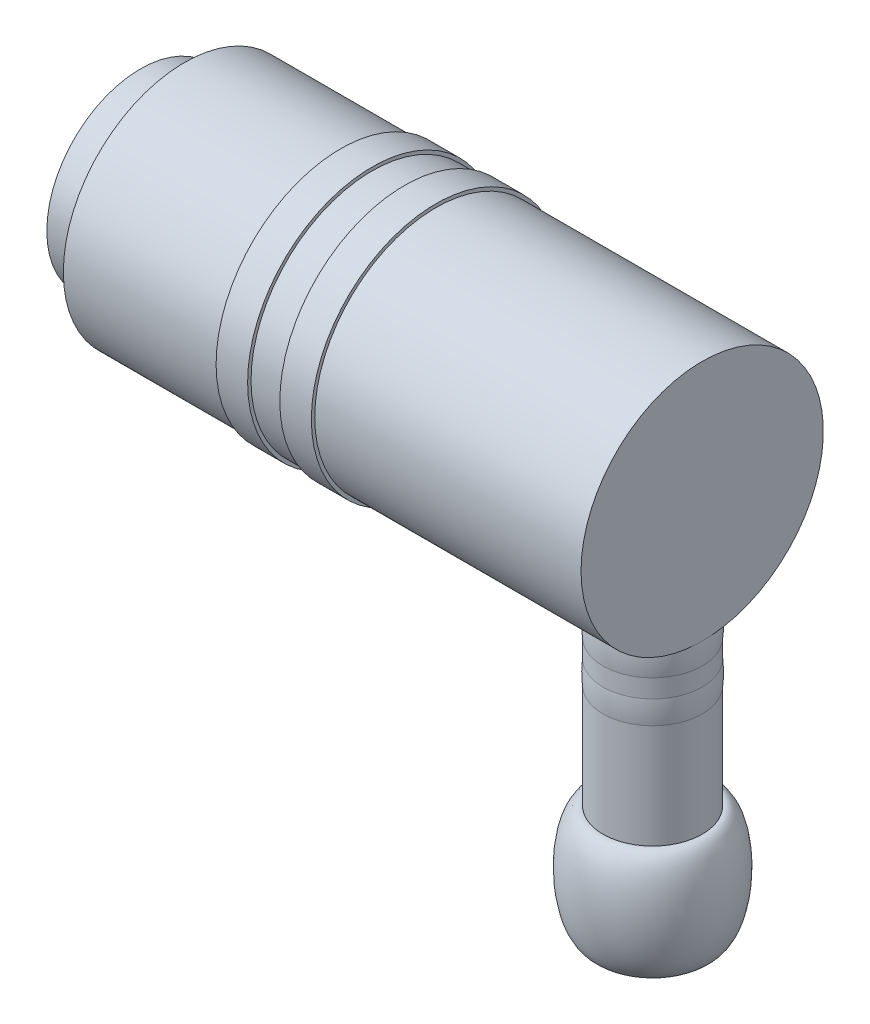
ISO-10303-21;
HEADER;
FILE_DESCRIPTION(('STEP AP214'),'2;1');
FILE_NAME('part.step','',(''),(''),'','','');
FILE_SCHEMA(('AUTOMOTIVE_DESIGN { 1 0 10303 214 1 1 1 1 }'));
ENDSEC;
DATA;
#1=APPLICATION_CONTEXT('core data for automotive mechanical design processes');
#2=APPLICATION_PROTOCOL_DEFINITION('international standard','automotive_design',2000,#1);
#3=PRODUCT_CONTEXT('',#1,'mechanical');
#4=PRODUCT('Part','Part','',(#3));
#5=PRODUCT_RELATED_PRODUCT_CATEGORY('part','',(#4));
#6=PRODUCT_DEFINITION_FORMATION('','',#4);
#7=PRODUCT_DEFINITION_CONTEXT('part definition',#1,'design');
#8=PRODUCT_DEFINITION('design','',#6,#7);
#9=PRODUCT_DEFINITION_SHAPE('','',#8);
#10=(LENGTH_UNIT() NAMED_UNIT(*) SI_UNIT(.MILLI.,.METRE.));
#11=(NAMED_UNIT(*) PLANE_ANGLE_UNIT() SI_UNIT($,.RADIAN.));
#12=(NAMED_UNIT(*) SI_UNIT($,.STERADIAN.) SOLID_ANGLE_UNIT());
#13=UNCERTAINTY_MEASURE_WITH_UNIT(LENGTH_MEASURE(1.E-05),#10,'distance_accuracy_value','');
#14=(GEOMETRIC_REPRESENTATION_CONTEXT(3) GLOBAL_UNCERTAINTY_ASSIGNED_CONTEXT((#13)) GLOBAL_UNIT_ASSIGNED_CONTEXT((#10,
#11,#12)) REPRESENTATION_CONTEXT('',''));
#15=CARTESIAN_POINT('',(0.,0.,0.));
#16=DIRECTION('',(0.,0.,1.));
#17=DIRECTION('',(1.,0.,0.));
#18=AXIS2_PLACEMENT_3D('',#15,#16,#17);
#19=CARTESIAN_POINT('',(46.5,-11.9034368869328,0.));
#20=DIRECTION('',(0.,1.,0.));
#21=DIRECTION('',(-1.,0.,0.));
#22=AXIS2_PLACEMENT_3D('',#19,#20,#21);
#23=DEGENERATE_TOROIDAL_SURFACE('',#22,6.24826094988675,10.8000061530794,.F.);
#24=CARTESIAN_POINT('',(46.5,-10.8474920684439,0.));
#25=DIRECTION('',(0.,1.,0.));
#26=DIRECTION('',(-1.,0.,0.));
#27=AXIS2_PLACEMENT_3D('',#24,#25,#26);
#28=CIRCLE('',#27,4.5);
#29=CARTESIAN_POINT('',(42.,-10.8474920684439,0.));
#30=VERTEX_POINT('',#29);
#31=EDGE_CURVE('P0_E9',#30,#30,#28,.T.);
#32=ORIENTED_EDGE('',*,*,#31,.F.);
#33=EDGE_LOOP('',(#32));
#34=FACE_BOUND('',#33,.T.);
#35=CARTESIAN_POINT('',(46.5,-12.9593817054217,0.));
#36=DIRECTION('',(0.,1.,0.));
#37=DIRECTION('',(-1.,0.,0.));
#38=AXIS2_PLACEMENT_3D('',#35,#36,#37);
#39=CIRCLE('',#38,4.5);
#40=CARTESIAN_POINT('',(42.,-12.9593817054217,0.));
#41=VERTEX_POINT('',#40);
#42=EDGE_CURVE('P0_E45',#41,#41,#39,.T.);
#43=ORIENTED_EDGE('',*,*,#42,.T.);
#44=EDGE_LOOP('',(#43));
#45=FACE_BOUND('',#44,.T.);
#46=ADVANCED_FACE('P0_F14',(#34,#45),#23,.F.);
#47=CARTESIAN_POINT('',(46.5,-8.48200597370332,0.));
#48=DIRECTION('',(0.,1.,0.));
#49=DIRECTION('',(-1.,0.,0.));
#50=AXIS2_PLACEMENT_3D('',#47,#48,#49);
#51=CYLINDRICAL_SURFACE('',#50,4.5);
#52=CARTESIAN_POINT('',(46.5,-8.48200597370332,0.));
#53=DIRECTION('',(0.,1.,0.));
#54=DIRECTION('',(-1.,0.,0.));
#55=AXIS2_PLACEMENT_3D('',#52,#53,#54);
#56=CIRCLE('',#55,4.5);
#57=CARTESIAN_POINT('',(42.,-8.48200597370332,0.));
#58=VERTEX_POINT('',#57);
#59=EDGE_CURVE('P0_E20',#58,#58,#56,.T.);
#60=ORIENTED_EDGE('',*,*,#59,.F.);
#61=EDGE_LOOP('',(#60));
#62=FACE_BOUND('',#61,.T.);
#63=ORIENTED_EDGE('',*,*,#31,.T.);
#64=EDGE_LOOP('',(#63));
#65=FACE_BOUND('',#64,.T.);
#66=ADVANCED_FACE('P0_F67',(#62,#65),#51,.T.);
#67=CARTESIAN_POINT('',(49.5,-8.48200597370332,0.));
#68=DIRECTION('',(0.,-1.,0.));
#69=DIRECTION('',(1.,0.,0.));
#70=AXIS2_PLACEMENT_3D('',#67,#68,#69);
#71=PLANE('',#70);
#72=CARTESIAN_POINT('',(46.5,-8.48200597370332,0.));
#73=DIRECTION('',(0.,1.,0.));
#74=DIRECTION('',(-1.,0.,0.));
#75=AXIS2_PLACEMENT_3D('',#72,#73,#74);
#76=CIRCLE('',#75,3.);
#77=CARTESIAN_POINT('',(43.5,-8.48200597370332,0.));
#78=VERTEX_POINT('',#77);
#79=EDGE_CURVE('P0_E24',#78,#78,#76,.T.);
#80=ORIENTED_EDGE('',*,*,#79,.F.);
#81=EDGE_LOOP('',(#80));
#82=FACE_BOUND('',#81,.T.);
#83=ORIENTED_EDGE('',*,*,#59,.T.);
#84=EDGE_LOOP('',(#83));
#85=FACE_BOUND('',#84,.T.);
#86=ADVANCED_FACE('P0_F64',(#82,#85),#71,.F.);
#87=CARTESIAN_POINT('',(46.5,-8.48200597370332,0.));
#88=DIRECTION('',(0.,1.,0.));
#89=DIRECTION('',(-1.,0.,0.));
#90=AXIS2_PLACEMENT_3D('',#87,#88,#89);
#91=CYLINDRICAL_SURFACE('',#90,3.);
#92=CARTESIAN_POINT('',(46.5,-36.4815664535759,0.));
#93=DIRECTION('',(0.,1.,0.));
#94=DIRECTION('',(-1.,0.,0.));
#95=AXIS2_PLACEMENT_3D('',#92,#93,#94);
#96=CIRCLE('',#95,3.);
#97=CARTESIAN_POINT('',(43.5,-36.4815664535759,0.));
#98=VERTEX_POINT('',#97);
#99=EDGE_CURVE('P0_E28',#98,#98,#96,.T.);
#100=ORIENTED_EDGE('',*,*,#99,.F.);
#101=EDGE_LOOP('',(#100));
#102=FACE_BOUND('',#101,.T.);
#103=ORIENTED_EDGE('',*,*,#79,.T.);
#104=EDGE_LOOP('',(#103));
#105=FACE_BOUND('',#104,.T.);
#106=ADVANCED_FACE('P0_F60',(#102,#105),#91,.F.);
#107=CARTESIAN_POINT('',(50.8431149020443,-36.4815664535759,0.));
#108=DIRECTION('',(0.,1.,0.));
#109=DIRECTION('',(-1.,0.,0.));
#110=AXIS2_PLACEMENT_3D('',#107,#108,#109);
#111=PLANE('',#110);
#112=CARTESIAN_POINT('',(46.5,-36.4815664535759,0.));
#113=DIRECTION('',(0.,1.,0.));
#114=DIRECTION('',(-1.,0.,0.));
#115=AXIS2_PLACEMENT_3D('',#112,#113,#114);
#116=CIRCLE('',#115,4.34311490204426);
#117=CARTESIAN_POINT('',(42.1568850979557,-36.4815664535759,0.));
#118=VERTEX_POINT('',#117);
#119=EDGE_CURVE('P0_E33',#118,#118,#116,.T.);
#120=ORIENTED_EDGE('',*,*,#119,.F.);
#121=EDGE_LOOP('',(#120));
#122=FACE_BOUND('',#121,.T.);
#123=ORIENTED_EDGE('',*,*,#99,.T.);
#124=EDGE_LOOP('',(#123));
#125=FACE_BOUND('',#124,.T.);
#126=ADVANCED_FACE('P0_F55',(#122,#125),#111,.F.);
#127=CARTESIAN_POINT('',(51.,-31.3260332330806,0.));
#128=DIRECTION('',(0.,0.,1.));
#129=DIRECTION('',(0.030416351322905,0.999537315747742,0.));
#130=AXIS2_PLACEMENT_3D('',#127,#128,#129);
#131=ELLIPSE('',#130,5.15791970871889,1.8774196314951);
#132=CARTESIAN_POINT('',(46.5,-8.48200597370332,0.));
#133=DIRECTION('',(0.,1.,0.));
#134=AXIS1_PLACEMENT('',#132,#133);
#135=SURFACE_OF_REVOLUTION('',#131,#134);
#136=CARTESIAN_POINT('',(46.5,-26.1836657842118,0.));
#137=DIRECTION('',(0.,1.,0.));
#138=DIRECTION('',(-1.,0.,0.));
#139=AXIS2_PLACEMENT_3D('',#136,#137,#138);
#140=CIRCLE('',#139,4.5);
#141=CARTESIAN_POINT('',(42.,-26.1836657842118,0.));
#142=VERTEX_POINT('',#141);
#143=EDGE_CURVE('P0_E36',#142,#142,#140,.T.);
#144=ORIENTED_EDGE('',*,*,#143,.F.);
#145=EDGE_LOOP('',(#144));
#146=FACE_BOUND('',#145,.T.);
#147=ORIENTED_EDGE('',*,*,#119,.T.);
#148=EDGE_LOOP('',(#147));
#149=FACE_BOUND('',#148,.T.);
#150=ADVANCED_FACE('P0_F50',(#146,#149),#135,.T.);
#151=CARTESIAN_POINT('',(46.5,-8.48200597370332,0.));
#152=DIRECTION('',(0.,1.,0.));
#153=DIRECTION('',(-1.,0.,0.));
#154=AXIS2_PLACEMENT_3D('',#151,#152,#153);
#155=CYLINDRICAL_SURFACE('',#154,4.5);
#156=CARTESIAN_POINT('',(46.5,-16.7283224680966,0.));
#157=DIRECTION('',(0.,1.,0.));
#158=DIRECTION('',(-1.,0.,0.));
#159=AXIS2_PLACEMENT_3D('',#156,#157,#158);
#160=CIRCLE('',#159,4.5);
#161=CARTESIAN_POINT('',(42.,-16.7283224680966,0.));
#162=VERTEX_POINT('',#161);
#163=EDGE_CURVE('P0_E39',#162,#162,#160,.T.);
#164=ORIENTED_EDGE('',*,*,#163,.F.);
#165=EDGE_LOOP('',(#164));
#166=FACE_BOUND('',#165,.T.);
#167=ORIENTED_EDGE('',*,*,#143,.T.);
#168=EDGE_LOOP('',(#167));
#169=FACE_BOUND('',#168,.T.);
#170=ADVANCED_FACE('P0_F54',(#166,#169),#155,.T.);
#171=CARTESIAN_POINT('',(46.5,-15.6723776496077,0.));
#172=DIRECTION('',(0.,1.,0.));
#173=DIRECTION('',(-1.,0.,0.));
#174=AXIS2_PLACEMENT_3D('',#171,#172,#173);
#175=DEGENERATE_TOROIDAL_SURFACE('',#174,6.24826094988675,10.8000061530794,.F.);
#176=CARTESIAN_POINT('',(46.5,-14.6164328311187,0.));
#177=DIRECTION('',(0.,1.,0.));
#178=DIRECTION('',(-1.,0.,0.));
#179=AXIS2_PLACEMENT_3D('',#176,#177,#178);
#180=CIRCLE('',#179,4.5);
#181=CARTESIAN_POINT('',(42.,-14.6164328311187,0.));
#182=VERTEX_POINT('',#181);
#183=EDGE_CURVE('P0_E42',#182,#182,#180,.T.);
#184=ORIENTED_EDGE('',*,*,#183,.F.);
#185=EDGE_LOOP('',(#184));
#186=FACE_BOUND('',#185,.T.);
#187=ORIENTED_EDGE('',*,*,#163,.T.);
#188=EDGE_LOOP('',(#187));
#189=FACE_BOUND('',#188,.T.);
#190=ADVANCED_FACE('P0_F86',(#186,#189),#175,.F.);
#191=CARTESIAN_POINT('',(46.5,-8.48200597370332,0.));
#192=DIRECTION('',(0.,1.,0.));
#193=DIRECTION('',(-1.,0.,0.));
#194=AXIS2_PLACEMENT_3D('',#191,#192,#193);
#195=CYLINDRICAL_SURFACE('',#194,4.5);
#196=ORIENTED_EDGE('',*,*,#42,.F.);
#197=EDGE_LOOP('',(#196));
#198=FACE_BOUND('',#197,.T.);
#199=ORIENTED_EDGE('',*,*,#183,.T.);
#200=EDGE_LOOP('',(#199));
#201=FACE_BOUND('',#200,.T.);
#202=ADVANCED_FACE('P0_F83',(#198,#201),#195,.T.);
#203=CLOSED_SHELL('',(#46,#66,#86,#106,#126,#150,#170,#190,#202));
#204=MANIFOLD_SOLID_BREP('P0_B1',#203);
#205=CARTESIAN_POINT('',(18.1763793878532,11.,0.));
#206=DIRECTION('',(1.,0.,0.));
#207=DIRECTION('',(0.,0.,-1.));
#208=AXIS2_PLACEMENT_3D('',#205,#206,#207);
#209=PLANE('',#208);
#210=CARTESIAN_POINT('',(18.1763793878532,0.,0.));
#211=DIRECTION('',(-1.,0.,0.));
#212=DIRECTION('',(0.,0.,1.));
#213=AXIS2_PLACEMENT_3D('',#210,#211,#212);
#214=CIRCLE('',#213,11.);
#215=CARTESIAN_POINT('',(18.1763793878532,0.,11.));
#216=VERTEX_POINT('',#215);
#217=EDGE_CURVE('P1_E63',#216,#216,#214,.T.);
#218=ORIENTED_EDGE('',*,*,#217,.F.);
#219=EDGE_LOOP('',(#218));
#220=FACE_BOUND('',#219,.T.);
#221=CARTESIAN_POINT('',(18.1763793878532,0.,0.));
#222=DIRECTION('',(-1.,0.,0.));
#223=DIRECTION('',(0.,0.,1.));
#224=AXIS2_PLACEMENT_3D('',#221,#222,#223);
#225=CIRCLE('',#224,11.3080956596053);
#226=CARTESIAN_POINT('',(18.1763793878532,0.,11.3080956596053));
#227=VERTEX_POINT('',#226);
#228=EDGE_CURVE('P1_E82',#227,#227,#225,.T.);
#229=ORIENTED_EDGE('',*,*,#228,.T.);
#230=EDGE_LOOP('',(#229));
#231=FACE_BOUND('',#230,.T.);
#232=ADVANCED_FACE('P1_F16',(#220,#231),#209,.F.);
#233=CARTESIAN_POINT('',(0.,0.,0.));
#234=DIRECTION('',(-1.,0.,0.));
#235=DIRECTION('',(0.,0.,1.));
#236=AXIS2_PLACEMENT_3D('',#233,#234,#235);
#237=CYLINDRICAL_SURFACE('',#236,11.3080956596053);
#238=ORIENTED_EDGE('',*,*,#228,.F.);
#239=EDGE_LOOP('',(#238));
#240=FACE_BOUND('',#239,.T.);
#241=CARTESIAN_POINT('',(21.0389220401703,0.,0.));
#242=DIRECTION('',(-1.,0.,0.));
#243=DIRECTION('',(0.,0.,1.));
#244=AXIS2_PLACEMENT_3D('',#241,#242,#243);
#245=CIRCLE('',#244,11.3080956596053);
#246=CARTESIAN_POINT('',(21.0389220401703,0.,11.3080956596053));
#247=VERTEX_POINT('',#246);
#248=EDGE_CURVE('P1_E118',#247,#247,#245,.T.);
#249=ORIENTED_EDGE('',*,*,#248,.T.);
#250=EDGE_LOOP('',(#249));
#251=FACE_BOUND('',#250,.T.);
#252=ADVANCED_FACE('P1_F105',(#240,#251),#237,.T.);
#253=CARTESIAN_POINT('',(21.0389220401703,11.3080956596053,0.));
#254=DIRECTION('',(-1.,0.,0.));
#255=DIRECTION('',(0.,0.,1.));
#256=AXIS2_PLACEMENT_3D('',#253,#254,#255);
#257=PLANE('',#256);
#258=ORIENTED_EDGE('',*,*,#248,.F.);
#259=EDGE_LOOP('',(#258));
#260=FACE_BOUND('',#259,.T.);
#261=CARTESIAN_POINT('',(21.0389220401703,0.,0.));
#262=DIRECTION('',(-1.,0.,0.));
#263=DIRECTION('',(0.,0.,1.));
#264=AXIS2_PLACEMENT_3D('',#261,#262,#263);
#265=CIRCLE('',#264,11.);
#266=CARTESIAN_POINT('',(21.0389220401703,0.,11.));
#267=VERTEX_POINT('',#266);
#268=EDGE_CURVE('P1_E120',#267,#267,#265,.T.);
#269=ORIENTED_EDGE('',*,*,#268,.T.);
#270=EDGE_LOOP('',(#269));
#271=FACE_BOUND('',#270,.T.);
#272=ADVANCED_FACE('P1_F111',(#260,#271),#257,.F.);
#273=CARTESIAN_POINT('',(0.,0.,0.));
#274=DIRECTION('',(-1.,0.,0.));
#275=DIRECTION('',(0.,0.,1.));
#276=AXIS2_PLACEMENT_3D('',#273,#274,#275);
#277=CYLINDRICAL_SURFACE('',#276,11.);
#278=ORIENTED_EDGE('',*,*,#268,.F.);
#279=EDGE_LOOP('',(#278));
#280=FACE_BOUND('',#279,.T.);
#281=CARTESIAN_POINT('',(23.9610779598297,0.,0.));
#282=DIRECTION('',(-1.,0.,0.));
#283=DIRECTION('',(0.,0.,1.));
#284=AXIS2_PLACEMENT_3D('',#281,#282,#283);
#285=CIRCLE('',#284,11.);
#286=CARTESIAN_POINT('',(23.9610779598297,0.,11.));
#287=VERTEX_POINT('',#286);
#288=EDGE_CURVE('P1_E124',#287,#287,#285,.T.);
#289=ORIENTED_EDGE('',*,*,#288,.T.);
#290=EDGE_LOOP('',(#289));
#291=FACE_BOUND('',#290,.T.);
#292=ADVANCED_FACE('P1_F254',(#280,#291),#277,.T.);
#293=CARTESIAN_POINT('',(23.9610779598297,11.3080956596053,0.));
#294=DIRECTION('',(1.,0.,0.));
#295=DIRECTION('',(0.,0.,-1.));
#296=AXIS2_PLACEMENT_3D('',#293,#294,#295);
#297=PLANE('',#296);
#298=ORIENTED_EDGE('',*,*,#288,.F.);
#299=EDGE_LOOP('',(#298));
#300=FACE_BOUND('',#299,.T.);
#301=CARTESIAN_POINT('',(23.9610779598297,0.,0.));
#302=DIRECTION('',(-1.,0.,0.));
#303=DIRECTION('',(0.,0.,1.));
#304=AXIS2_PLACEMENT_3D('',#301,#302,#303);
#305=CIRCLE('',#304,11.3080956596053);
#306=CARTESIAN_POINT('',(23.9610779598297,0.,11.3080956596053));
#307=VERTEX_POINT('',#306);
#308=EDGE_CURVE('P1_E129',#307,#307,#305,.T.);
#309=ORIENTED_EDGE('',*,*,#308,.T.);
#310=EDGE_LOOP('',(#309));
#311=FACE_BOUND('',#310,.T.);
#312=ADVANCED_FACE('P1_F262',(#300,#311),#297,.F.);
#313=CARTESIAN_POINT('',(0.,0.,0.));
#314=DIRECTION('',(-1.,0.,0.));
#315=DIRECTION('',(0.,0.,1.));
#316=AXIS2_PLACEMENT_3D('',#313,#314,#315);
#317=CYLINDRICAL_SURFACE('',#316,11.3080956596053);
#318=ORIENTED_EDGE('',*,*,#308,.F.);
#319=EDGE_LOOP('',(#318));
#320=FACE_BOUND('',#319,.T.);
#321=CARTESIAN_POINT('',(26.8236206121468,0.,0.));
#322=DIRECTION('',(-1.,0.,0.));
#323=DIRECTION('',(0.,0.,1.));
#324=AXIS2_PLACEMENT_3D('',#321,#322,#323);
#325=CIRCLE('',#324,11.3080956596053);
#326=CARTESIAN_POINT('',(26.8236206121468,0.,11.3080956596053));
#327=VERTEX_POINT('',#326);
#328=EDGE_CURVE('P1_E132',#327,#327,#325,.T.);
#329=ORIENTED_EDGE('',*,*,#328,.T.);
#330=EDGE_LOOP('',(#329));
#331=FACE_BOUND('',#330,.T.);
#332=ADVANCED_FACE('P1_F271',(#320,#331),#317,.T.);
#333=CARTESIAN_POINT('',(26.8236206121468,11.,0.));
#334=DIRECTION('',(-1.,0.,0.));
#335=DIRECTION('',(0.,0.,1.));
#336=AXIS2_PLACEMENT_3D('',#333,#334,#335);
#337=PLANE('',#336);
#338=ORIENTED_EDGE('',*,*,#328,.F.);
#339=EDGE_LOOP('',(#338));
#340=FACE_BOUND('',#339,.T.);
#341=CARTESIAN_POINT('',(26.8236206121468,0.,0.));
#342=DIRECTION('',(-1.,0.,0.));
#343=DIRECTION('',(0.,0.,1.));
#344=AXIS2_PLACEMENT_3D('',#341,#342,#343);
#345=CIRCLE('',#344,11.);
#346=CARTESIAN_POINT('',(26.8236206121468,0.,11.));
#347=VERTEX_POINT('',#346);
#348=EDGE_CURVE('P1_E135',#347,#347,#345,.T.);
#349=ORIENTED_EDGE('',*,*,#348,.T.);
#350=EDGE_LOOP('',(#349));
#351=FACE_BOUND('',#350,.T.);
#352=ADVANCED_FACE('P1_F101',(#340,#351),#337,.F.);
#353=CARTESIAN_POINT('',(0.,0.,0.));
#354=DIRECTION('',(-1.,0.,0.));
#355=DIRECTION('',(0.,0.,1.));
#356=AXIS2_PLACEMENT_3D('',#353,#354,#355);
#357=CYLINDRICAL_SURFACE('',#356,11.);
#358=CARTESIAN_POINT('',(46.5,-10.816653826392,-2.));
#359=CARTESIAN_POINT('',(46.388659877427,-10.8166559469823,-1.99999566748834));
#360=CARTESIAN_POINT('',(46.277262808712,-10.818391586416,-1.99067100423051));
#361=CARTESIAN_POINT('',(46.0576053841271,-10.825138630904,-1.953641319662));
#362=CARTESIAN_POINT('',(45.9493478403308,-10.8301528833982,-1.92592032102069));
#363=CARTESIAN_POINT('',(45.7391796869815,-10.8428709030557,-1.85297369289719));
#364=CARTESIAN_POINT('',(45.637263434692,-10.8505722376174,-1.80776389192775));
#365=CARTESIAN_POINT('',(45.4424701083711,-10.8677937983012,-1.70116425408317));
#366=CARTESIAN_POINT('',(45.3495922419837,-10.8773138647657,-1.63977583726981));
#367=CARTESIAN_POINT('',(45.1744165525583,-10.8972247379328,-1.50179524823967));
#368=CARTESIAN_POINT('',(45.0922399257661,-10.9076236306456,-1.42505035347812));
#369=CARTESIAN_POINT('',(44.9418544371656,-10.9280489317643,-1.25886539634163));
#370=CARTESIAN_POINT('',(44.8736464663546,-10.9380753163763,-1.1694245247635));
#371=CARTESIAN_POINT('',(44.7526726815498,-10.9567122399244,-0.979593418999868));
#372=CARTESIAN_POINT('',(44.7000207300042,-10.965312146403,-0.879129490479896));
#373=CARTESIAN_POINT('',(44.6123866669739,-10.9800367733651,-0.670599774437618));
#374=CARTESIAN_POINT('',(44.5774031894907,-10.98616168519,-0.562534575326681));
#375=CARTESIAN_POINT('',(44.5264727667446,-10.9951891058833,-0.343124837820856));
#376=CARTESIAN_POINT('',(44.5103216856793,-10.9981261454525,-0.231829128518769));
#377=CARTESIAN_POINT('',(44.4968788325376,-11.0005658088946,-0.00807147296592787));
#378=CARTESIAN_POINT('',(44.4995855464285,-11.0000687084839,0.104390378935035));
#379=CARTESIAN_POINT('',(44.5236241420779,-10.9957231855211,0.325889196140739));
#380=CARTESIAN_POINT('',(44.5447362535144,-10.9919143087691,0.43495090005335));
#381=CARTESIAN_POINT('',(44.6046391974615,-10.9814174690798,0.647957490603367));
#382=CARTESIAN_POINT('',(44.6434306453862,-10.974729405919,0.751902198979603));
#383=CARTESIAN_POINT('',(44.7378030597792,-10.9591592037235,0.952366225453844));
#384=CARTESIAN_POINT('',(44.7934726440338,-10.9502655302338,1.04884289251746));
#385=CARTESIAN_POINT('',(44.9199558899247,-10.9312689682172,1.23116763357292));
#386=CARTESIAN_POINT('',(44.9907710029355,-10.9211659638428,1.31701468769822));
#387=CARTESIAN_POINT('',(45.1467484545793,-10.9006990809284,1.47694445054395));
#388=CARTESIAN_POINT('',(45.232103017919,-10.8903335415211,1.5508395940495));
#389=CARTESIAN_POINT('',(45.4140940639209,-10.8706496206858,1.68329271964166));
#390=CARTESIAN_POINT('',(45.5107306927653,-10.861331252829,1.74185050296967));
#391=CARTESIAN_POINT('',(45.7127825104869,-10.8447947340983,1.84201538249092));
#392=CARTESIAN_POINT('',(45.8182108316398,-10.8375798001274,1.88359655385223));
#393=CARTESIAN_POINT('',(46.0347174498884,-10.8261173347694,1.94840376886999));
#394=CARTESIAN_POINT('',(46.1457951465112,-10.8218694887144,1.97163175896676));
#395=CARTESIAN_POINT('',(46.3687598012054,-10.8168840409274,1.99880217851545));
#396=CARTESIAN_POINT('',(46.4806129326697,-10.8160975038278,2.00301348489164));
#397=CARTESIAN_POINT('',(46.7034245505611,-10.8179929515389,1.9927505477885));
#398=CARTESIAN_POINT('',(46.814383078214,-10.8206747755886,1.97827717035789));
#399=CARTESIAN_POINT('',(47.0313803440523,-10.8291592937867,1.93128609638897));
#400=CARTESIAN_POINT('',(47.1374503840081,-10.8349378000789,1.89890818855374));
#401=CARTESIAN_POINT('',(47.3426597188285,-10.8489439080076,1.81717497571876));
#402=CARTESIAN_POINT('',(47.4417985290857,-10.8571716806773,1.76781848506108));
#403=CARTESIAN_POINT('',(47.6315191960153,-10.8752613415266,1.65290586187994));
#404=CARTESIAN_POINT('',(47.7219961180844,-10.8851400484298,1.58717917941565));
#405=CARTESIAN_POINT('',(47.8907336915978,-10.9053706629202,1.44162304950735));
#406=CARTESIAN_POINT('',(47.9689933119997,-10.91572261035,1.36179241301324));
#407=CARTESIAN_POINT('',(48.1120728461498,-10.9358898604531,1.18909630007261));
#408=CARTESIAN_POINT('',(48.1767123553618,-10.9456968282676,1.09608023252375));
#409=CARTESIAN_POINT('',(48.289446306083,-10.9635308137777,0.900352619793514));
#410=CARTESIAN_POINT('',(48.3375413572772,-10.9715578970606,0.797641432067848));
#411=CARTESIAN_POINT('',(48.4155480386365,-10.9848917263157,0.585948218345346));
#412=CARTESIAN_POINT('',(48.4455499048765,-10.9902119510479,0.477000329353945));
#413=CARTESIAN_POINT('',(48.4868073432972,-10.9975899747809,0.25550664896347));
#414=CARTESIAN_POINT('',(48.4980647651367,-10.9996480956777,0.142961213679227));
#415=CARTESIAN_POINT('',(48.5014525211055,-11.0002641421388,-0.0807996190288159));
#416=CARTESIAN_POINT('',(48.4938558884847,-10.9988720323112,-0.192010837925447));
#417=CARTESIAN_POINT('',(48.4603470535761,-10.9928473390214,-0.411544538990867));
#418=CARTESIAN_POINT('',(48.434435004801,-10.9882147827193,-0.519867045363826));
#419=CARTESIAN_POINT('',(48.3651430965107,-10.9762290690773,-0.730415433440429));
#420=CARTESIAN_POINT('',(48.3217906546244,-10.96888018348,-0.832650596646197));
#421=CARTESIAN_POINT('',(48.2188805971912,-10.9522592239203,-1.02843701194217));
#422=CARTESIAN_POINT('',(48.1593219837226,-10.9429870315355,-1.12198772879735));
#423=CARTESIAN_POINT('',(48.0247423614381,-10.9233859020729,-1.29911459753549));
#424=CARTESIAN_POINT('',(47.9495233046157,-10.9130443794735,-1.38253889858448));
#425=CARTESIAN_POINT('',(47.7861704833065,-10.8925517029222,-1.53567622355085));
#426=CARTESIAN_POINT('',(47.6980336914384,-10.8824005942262,-1.60538602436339));
#427=CARTESIAN_POINT('',(47.5104403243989,-10.8633428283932,-1.72967671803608));
#428=CARTESIAN_POINT('',(47.4108927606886,-10.8544476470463,-1.78412208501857));
#429=CARTESIAN_POINT('',(47.203936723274,-10.8390461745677,-1.87543058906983));
#430=CARTESIAN_POINT('',(47.0965359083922,-10.8325375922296,-1.9123105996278));
#431=CARTESIAN_POINT('',(46.9073233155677,-10.8240281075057,-1.95979896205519));
#432=CARTESIAN_POINT('',(46.8266307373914,-10.821278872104,-1.97484899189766));
#433=CARTESIAN_POINT('',(46.6639690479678,-10.8175909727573,-1.99495098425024));
#434=CARTESIAN_POINT('',(46.5819999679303,-10.8166522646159,-2.00000319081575));
#435=CARTESIAN_POINT('',(46.5,-10.816653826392,-2.));
#436=B_SPLINE_CURVE_WITH_KNOTS('',3,(#358,#359,#360,#361,#362,#363,#364,#365,#366,#367,#368,
#369,#370,#371,#372,#373,#374,#375,#376,#377,#378,#379,#380,#381,#382,#383,#384,#385,#386,#387,
#388,#389,#390,#391,#392,#393,#394,#395,#396,#397,#398,#399,#400,#401,#402,#403,#404,#405,#406,
#407,#408,#409,#410,#411,#412,#413,#414,#415,#416,#417,#418,#419,#420,#421,#422,#423,#424,#425,
#426,#427,#428,#429,#430,#431,#432,#433,#434,#435),.UNSPECIFIED.,.T.,.F.,(4,2,2,2,2,2,2,2,2,2,2,
2,2,2,2,2,2,2,2,2,2,2,2,2,2,2,2,2,2,2,2,2,2,2,2,2,2,2,4),(0.,0.333720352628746,0.66773092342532,
1.00143989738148,1.33511959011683,1.67229935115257,2.00950061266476,2.34911212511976,
2.68869737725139,3.02456639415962,3.36040844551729,3.69229445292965,4.02419201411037,
4.35786328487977,4.69156654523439,5.03008350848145,5.36860485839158,5.70764124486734,
6.04664167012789,6.38083364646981,6.71501013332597,7.0466136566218,7.37824034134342,
7.71347820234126,8.04874433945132,8.38820522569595,8.72765360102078,9.06539473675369,
9.40310254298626,9.73594847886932,10.0687916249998,10.4011135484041,10.7334559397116,
11.0702887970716,11.4072007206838,11.7470154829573,12.0865031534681,12.3322881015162,
12.5780670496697),.UNSPECIFIED.);
#437=CARTESIAN_POINT('',(46.5,-10.816653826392,-2.));
#438=VERTEX_POINT('',#437);
#439=EDGE_CURVE('P1_E53',#438,#438,#436,.T.);
#440=ORIENTED_EDGE('',*,*,#439,.T.);
#441=EDGE_LOOP('',(#440));
#442=FACE_BOUND('',#441,.T.);
#443=ORIENTED_EDGE('',*,*,#348,.F.);
#444=EDGE_LOOP('',(#443));
#445=FACE_BOUND('',#444,.T.);
#446=CARTESIAN_POINT('',(51.,0.,0.));
#447=DIRECTION('',(-1.,0.,0.));
#448=DIRECTION('',(0.,0.,1.));
#449=AXIS2_PLACEMENT_3D('',#446,#447,#448);
#450=CIRCLE('',#449,11.);
#451=CARTESIAN_POINT('',(51.,0.,11.));
#452=VERTEX_POINT('',#451);
#453=EDGE_CURVE('P1_E138',#452,#452,#450,.T.);
#454=ORIENTED_EDGE('',*,*,#453,.T.);
#455=EDGE_LOOP('',(#454));
#456=FACE_BOUND('',#455,.T.);
#457=ADVANCED_FACE('P1_F65',(#442,#445,#456),#357,.T.);
#458=CARTESIAN_POINT('',(51.,6.5,0.));
#459=DIRECTION('',(-1.,0.,0.));
#460=DIRECTION('',(0.,0.,1.));
#461=AXIS2_PLACEMENT_3D('',#458,#459,#460);
#462=PLANE('',#461);
#463=ORIENTED_EDGE('',*,*,#453,.F.);
#464=EDGE_LOOP('',(#463));
#465=FACE_BOUND('',#464,.T.);
#466=ADVANCED_FACE('P1_F93',(#465),#462,.F.);
#467=CARTESIAN_POINT('',(48.,0.,0.));
#468=DIRECTION('',(1.,0.,0.));
#469=DIRECTION('',(0.,0.,-1.));
#470=AXIS2_PLACEMENT_3D('',#467,#468,#469);
#471=PLANE('',#470);
#472=DIRECTION('',(0.,0.,1.));
#473=VECTOR('',#472,1.);
#474=CARTESIAN_POINT('',(48.,-4.2253404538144,0.));
#475=LINE('',#474,#473);
#476=CARTESIAN_POINT('',(48.,-4.2253404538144,-1.32287565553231));
#477=VERTEX_POINT('',#476);
#478=CARTESIAN_POINT('',(48.,-4.2253404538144,1.32287565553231));
#479=VERTEX_POINT('',#478);
#480=EDGE_CURVE('P1_E10',#477,#479,#475,.T.);
#481=ORIENTED_EDGE('',*,*,#480,.T.);
#482=DIRECTION('',(0.,-1.,0.));
#483=VECTOR('',#482,1.);
#484=CARTESIAN_POINT('',(48.,-36.4815664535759,1.32287565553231));
#485=LINE('',#484,#483);
#486=CARTESIAN_POINT('',(48.,-6.36396103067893,1.32287565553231));
#487=VERTEX_POINT('',#486);
#488=EDGE_CURVE('P1_E46',#479,#487,#485,.T.);
#489=ORIENTED_EDGE('',*,*,#488,.T.);
#490=CARTESIAN_POINT('',(48.,0.,0.));
#491=DIRECTION('',(-1.,0.,0.));
#492=DIRECTION('',(0.,0.,1.));
#493=AXIS2_PLACEMENT_3D('',#490,#491,#492);
#494=CIRCLE('',#493,6.5);
#495=CARTESIAN_POINT('',(48.,-6.36396103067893,-1.32287565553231));
#496=VERTEX_POINT('',#495);
#497=EDGE_CURVE('P1_E51',#487,#496,#494,.T.);
#498=ORIENTED_EDGE('',*,*,#497,.T.);
#499=DIRECTION('',(0.,-1.,0.));
#500=VECTOR('',#499,1.);
#501=CARTESIAN_POINT('',(48.,-36.4815664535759,-1.32287565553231));
#502=LINE('',#501,#500);
#503=EDGE_CURVE('P1_E30',#496,#477,#502,.F.);
#504=ORIENTED_EDGE('',*,*,#503,.T.);
#505=EDGE_LOOP('',(#481,#489,#498,#504));
#506=FACE_BOUND('',#505,.T.);
#507=ADVANCED_FACE('P1_F49',(#506),#471,.F.);
#508=CARTESIAN_POINT('',(0.,0.,0.));
#509=DIRECTION('',(-1.,0.,0.));
#510=DIRECTION('',(0.,0.,1.));
#511=AXIS2_PLACEMENT_3D('',#508,#509,#510);
#512=CYLINDRICAL_SURFACE('',#511,6.5);
#513=ORIENTED_EDGE('',*,*,#497,.F.);
#514=CARTESIAN_POINT('',(48.,-6.36396103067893,1.32287565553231));
#515=CARTESIAN_POINT('',(47.9628303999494,-6.35520136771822,1.36501867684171));
#516=CARTESIAN_POINT('',(47.9239163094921,-6.34633579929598,1.40556409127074));
#517=CARTESIAN_POINT('',(47.8428115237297,-6.32863098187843,1.48324484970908));
#518=CARTESIAN_POINT('',(47.8006206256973,-6.31979173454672,1.52037998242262));
#519=CARTESIAN_POINT('',(47.6694282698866,-6.2936663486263,1.62636456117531));
#520=CARTESIAN_POINT('',(47.5758332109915,-6.2767789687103,1.68976367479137));
#521=CARTESIAN_POINT('',(47.3788398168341,-6.24603008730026,1.80011503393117));
#522=CARTESIAN_POINT('',(47.2754300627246,-6.23217217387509,1.84704781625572));
#523=CARTESIAN_POINT('',(47.0617526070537,-6.2092126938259,1.92282519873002));
#524=CARTESIAN_POINT('',(46.9514917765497,-6.20010644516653,1.9516876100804));
#525=CARTESIAN_POINT('',(46.7306107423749,-6.18800289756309,1.9897267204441));
#526=CARTESIAN_POINT('',(46.6200943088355,-6.18483558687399,1.99945167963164));
#527=CARTESIAN_POINT('',(46.3989450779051,-6.18449594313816,2.0005030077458));
#528=CARTESIAN_POINT('',(46.2883122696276,-6.18732423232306,1.99182746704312));
#529=CARTESIAN_POINT('',(46.073610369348,-6.19843908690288,1.95695311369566));
#530=CARTESIAN_POINT('',(45.9694439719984,-6.20655749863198,1.93129377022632));
#531=CARTESIAN_POINT('',(45.7669317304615,-6.2271364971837,1.8638681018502));
#532=CARTESIAN_POINT('',(45.6685862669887,-6.23959736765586,1.82210072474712));
#533=CARTESIAN_POINT('',(45.4777379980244,-6.26784472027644,1.72245757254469));
#534=CARTESIAN_POINT('',(45.3854447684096,-6.28370706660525,1.66420253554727));
#535=CARTESIAN_POINT('',(45.2116748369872,-6.31684189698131,1.53363514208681));
#536=CARTESIAN_POINT('',(45.1302011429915,-6.33411477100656,1.46131889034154));
#537=CARTESIAN_POINT('',(44.9768962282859,-6.36899019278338,1.3011318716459));
#538=CARTESIAN_POINT('',(44.9056028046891,-6.38657685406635,1.21274170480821));
#539=CARTESIAN_POINT('',(44.7788155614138,-6.41940149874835,1.02487274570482));
#540=CARTESIAN_POINT('',(44.7233213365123,-6.43463954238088,0.925394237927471));
#541=CARTESIAN_POINT('',(44.6300587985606,-6.46101230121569,0.718431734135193));
#542=CARTESIAN_POINT('',(44.5922167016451,-6.47216405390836,0.610983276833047));
#543=CARTESIAN_POINT('',(44.5352702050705,-6.48917683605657,0.390836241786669));
#544=CARTESIAN_POINT('',(44.5161601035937,-6.49503947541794,0.278139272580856));
#545=CARTESIAN_POINT('',(44.497781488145,-6.50067755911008,0.055565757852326));
#546=CARTESIAN_POINT('',(44.4977460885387,-6.50068827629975,-0.0542419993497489));
#547=CARTESIAN_POINT('',(44.5156000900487,-6.4952114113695,-0.272241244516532));
#548=CARTESIAN_POINT('',(44.5334880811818,-6.48972426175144,-0.380432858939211));
#549=CARTESIAN_POINT('',(44.5861485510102,-6.47396423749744,-0.590537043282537));
#550=CARTESIAN_POINT('',(44.6206691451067,-6.46376284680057,-0.69251850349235));
#551=CARTESIAN_POINT('',(44.7053778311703,-6.4396448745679,-0.889274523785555));
#552=CARTESIAN_POINT('',(44.755568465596,-6.42572769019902,-0.984047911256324));
#553=CARTESIAN_POINT('',(44.8720094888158,-6.39508460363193,-1.16694739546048));
#554=CARTESIAN_POINT('',(44.9387147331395,-6.37828421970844,-1.25477126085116));
#555=CARTESIAN_POINT('',(45.0855416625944,-6.34394239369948,-1.41823266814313));
#556=CARTESIAN_POINT('',(45.165666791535,-6.32640076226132,-1.49386707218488));
#557=CARTESIAN_POINT('',(45.3402792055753,-6.2918518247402,-1.6333853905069));
#558=CARTESIAN_POINT('',(45.4351583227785,-6.2748822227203,-1.69678962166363));
#559=CARTESIAN_POINT('',(45.63471315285,-6.2441191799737,-1.80672345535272));
#560=CARTESIAN_POINT('',(45.7393875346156,-6.23032530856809,-1.85325534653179));
#561=CARTESIAN_POINT('',(45.9539277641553,-6.20781850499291,-1.92729731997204));
#562=CARTESIAN_POINT('',(46.0636854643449,-6.19902874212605,-1.9550963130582));
#563=CARTESIAN_POINT('',(46.2866100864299,-6.1873394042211,-1.99178652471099));
#564=CARTESIAN_POINT('',(46.3997758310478,-6.18443781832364,-2.00068419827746));
#565=CARTESIAN_POINT('',(46.621006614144,-6.18489558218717,-1.99926479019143));
#566=CARTESIAN_POINT('',(46.7290785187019,-6.18798696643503,-1.9897701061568));
#567=CARTESIAN_POINT('',(46.9420012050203,-6.19952077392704,-1.95353459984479));
#568=CARTESIAN_POINT('',(47.046851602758,-6.20796383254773,-1.92679172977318));
#569=CARTESIAN_POINT('',(47.2503269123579,-6.22918504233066,-1.85703277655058));
#570=CARTESIAN_POINT('',(47.3489600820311,-6.24195729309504,-1.81403883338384));
#571=CARTESIAN_POINT('',(47.5377391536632,-6.27042193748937,-1.71305146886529));
#572=CARTESIAN_POINT('',(47.6278879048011,-6.28611334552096,-1.6550631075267));
#573=CARTESIAN_POINT('',(47.7649216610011,-6.31247894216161,-1.55057791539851));
#574=CARTESIAN_POINT('',(47.8151118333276,-6.32276185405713,-1.50823830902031));
#575=CARTESIAN_POINT('',(47.9109890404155,-6.34339881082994,-1.41894020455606));
#576=CARTESIAN_POINT('',(47.9566849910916,-6.35375266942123,-1.37199123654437));
#577=CARTESIAN_POINT('',(48.,-6.36396103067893,-1.32287565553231));
#578=B_SPLINE_CURVE_WITH_KNOTS('',3,(#514,#515,#516,#517,#518,#519,#520,#521,#522,#523,#524,
#525,#526,#527,#528,#529,#530,#531,#532,#533,#534,#535,#536,#537,#538,#539,#540,#541,#542,#543,
#544,#545,#546,#547,#548,#549,#550,#551,#552,#553,#554,#555,#556,#557,#558,#559,#560,#561,#562,
#563,#564,#565,#566,#567,#568,#569,#570,#571,#572,#573,#574,#575,#576,#577),.UNSPECIFIED.,.F.,
.F.,(4,2,2,2,2,2,2,2,2,2,2,2,2,2,2,2,2,2,2,2,2,2,2,2,2,2,2,2,2,2,2,4),(0.,0.170510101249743,
0.341030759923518,0.682190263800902,1.02375167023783,1.36497588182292,1.69627336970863,
2.027605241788,2.34888767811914,2.67019110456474,2.99958803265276,3.32907634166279,
3.67218447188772,4.01528380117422,4.35693587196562,4.69848391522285,5.02629918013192,
5.35408865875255,5.67706307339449,6.00008991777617,6.33326143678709,6.66651858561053,
7.0109628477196,7.35536037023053,7.69431675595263,8.0331573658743,8.35719606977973,
8.68127325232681,9.00491050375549,9.32843868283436,9.52754385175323,9.72624569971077),.UNSPECIFIED.);
#579=EDGE_CURVE('P1_E23',#487,#496,#578,.T.);
#580=ORIENTED_EDGE('',*,*,#579,.T.);
#581=EDGE_LOOP('',(#513,#580));
#582=FACE_BOUND('',#581,.T.);
#583=CARTESIAN_POINT('',(0.,0.,0.));
#584=DIRECTION('',(-1.,0.,0.));
#585=DIRECTION('',(0.,0.,1.));
#586=AXIS2_PLACEMENT_3D('',#583,#584,#585);
#587=CIRCLE('',#586,6.5);
#588=CARTESIAN_POINT('',(0.,0.,6.5));
#589=VERTEX_POINT('',#588);
#590=EDGE_CURVE('P1_E142',#589,#589,#587,.T.);
#591=ORIENTED_EDGE('',*,*,#590,.T.);
#592=EDGE_LOOP('',(#591));
#593=FACE_BOUND('',#592,.T.);
#594=ADVANCED_FACE('P1_F84',(#582,#593),#512,.F.);
#595=CARTESIAN_POINT('',(0.,6.5,0.));
#596=DIRECTION('',(1.,0.,0.));
#597=DIRECTION('',(0.,0.,-1.));
#598=AXIS2_PLACEMENT_3D('',#595,#596,#597);
#599=PLANE('',#598);
#600=ORIENTED_EDGE('',*,*,#590,.F.);
#601=EDGE_LOOP('',(#600));
#602=FACE_BOUND('',#601,.T.);
#603=CARTESIAN_POINT('',(0.,0.,0.));
#604=DIRECTION('',(-1.,0.,0.));
#605=DIRECTION('',(0.,0.,1.));
#606=AXIS2_PLACEMENT_3D('',#603,#604,#605);
#607=CIRCLE('',#606,8.5);
#608=CARTESIAN_POINT('',(0.,0.,8.5));
#609=VERTEX_POINT('',#608);
#610=EDGE_CURVE('P1_E145',#609,#609,#607,.T.);
#611=ORIENTED_EDGE('',*,*,#610,.T.);
#612=EDGE_LOOP('',(#611));
#613=FACE_BOUND('',#612,.T.);
#614=ADVANCED_FACE('P1_F89',(#602,#613),#599,.F.);
#615=CARTESIAN_POINT('',(0.,0.,0.));
#616=DIRECTION('',(-1.,0.,0.));
#617=DIRECTION('',(0.,0.,1.));
#618=AXIS2_PLACEMENT_3D('',#615,#616,#617);
#619=CYLINDRICAL_SURFACE('',#618,8.5);
#620=ORIENTED_EDGE('',*,*,#610,.F.);
#621=EDGE_LOOP('',(#620));
#622=FACE_BOUND('',#621,.T.);
#623=CARTESIAN_POINT('',(4.,0.,0.));
#624=DIRECTION('',(-1.,0.,0.));
#625=DIRECTION('',(0.,0.,1.));
#626=AXIS2_PLACEMENT_3D('',#623,#624,#625);
#627=CIRCLE('',#626,8.5);
#628=CARTESIAN_POINT('',(4.,0.,8.5));
#629=VERTEX_POINT('',#628);
#630=EDGE_CURVE('P1_E148',#629,#629,#627,.T.);
#631=ORIENTED_EDGE('',*,*,#630,.T.);
#632=EDGE_LOOP('',(#631));
#633=FACE_BOUND('',#632,.T.);
#634=ADVANCED_FACE('P1_F163',(#622,#633),#619,.T.);
#635=CARTESIAN_POINT('',(4.,8.5,0.));
#636=DIRECTION('',(1.,0.,0.));
#637=DIRECTION('',(0.,0.,-1.));
#638=AXIS2_PLACEMENT_3D('',#635,#636,#637);
#639=PLANE('',#638);
#640=ORIENTED_EDGE('',*,*,#630,.F.);
#641=EDGE_LOOP('',(#640));
#642=FACE_BOUND('',#641,.T.);
#643=CARTESIAN_POINT('',(4.,0.,0.));
#644=DIRECTION('',(-1.,0.,0.));
#645=DIRECTION('',(0.,0.,1.));
#646=AXIS2_PLACEMENT_3D('',#643,#644,#645);
#647=CIRCLE('',#646,11.);
#648=CARTESIAN_POINT('',(4.,0.,11.));
#649=VERTEX_POINT('',#648);
#650=EDGE_CURVE('P1_E150',#649,#649,#647,.T.);
#651=ORIENTED_EDGE('',*,*,#650,.T.);
#652=EDGE_LOOP('',(#651));
#653=FACE_BOUND('',#652,.T.);
#654=ADVANCED_FACE('P1_F156',(#642,#653),#639,.F.);
#655=CARTESIAN_POINT('',(0.,0.,0.));
#656=DIRECTION('',(-1.,0.,0.));
#657=DIRECTION('',(0.,0.,1.));
#658=AXIS2_PLACEMENT_3D('',#655,#656,#657);
#659=CYLINDRICAL_SURFACE('',#658,11.);
#660=ORIENTED_EDGE('',*,*,#650,.F.);
#661=EDGE_LOOP('',(#660));
#662=FACE_BOUND('',#661,.T.);
#663=ORIENTED_EDGE('',*,*,#217,.T.);
#664=EDGE_LOOP('',(#663));
#665=FACE_BOUND('',#664,.T.);
#666=ADVANCED_FACE('P1_F73',(#662,#665),#659,.T.);
#667=CARTESIAN_POINT('',(48.5,-4.2253404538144,0.));
#668=DIRECTION('',(0.,1.,0.));
#669=DIRECTION('',(0.,0.,1.));
#670=AXIS2_PLACEMENT_3D('',#667,#668,#669);
#671=PLANE('',#670);
#672=CARTESIAN_POINT('',(46.5,-4.2253404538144,0.));
#673=DIRECTION('',(0.,-1.,0.));
#674=DIRECTION('',(0.,0.,-1.));
#675=AXIS2_PLACEMENT_3D('',#672,#673,#674);
#676=CIRCLE('',#675,2.);
#677=EDGE_CURVE('P1_E42',#477,#479,#676,.T.);
#678=ORIENTED_EDGE('',*,*,#677,.T.);
#679=ORIENTED_EDGE('',*,*,#480,.F.);
#680=EDGE_LOOP('',(#678,#679));
#681=FACE_BOUND('',#680,.T.);
#682=ADVANCED_FACE('P1_F41',(#681),#671,.F.);
#683=CARTESIAN_POINT('',(46.5,-36.4815664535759,0.));
#684=DIRECTION('',(0.,-1.,0.));
#685=DIRECTION('',(0.,0.,-1.));
#686=AXIS2_PLACEMENT_3D('',#683,#684,#685);
#687=CYLINDRICAL_SURFACE('',#686,2.);
#688=ORIENTED_EDGE('',*,*,#677,.F.);
#689=ORIENTED_EDGE('',*,*,#503,.F.);
#690=ORIENTED_EDGE('',*,*,#579,.F.);
#691=ORIENTED_EDGE('',*,*,#488,.F.);
#692=EDGE_LOOP('',(#688,#689,#690,#691));
#693=FACE_BOUND('',#692,.T.);
#694=ORIENTED_EDGE('',*,*,#439,.F.);
#695=EDGE_LOOP('',(#694));
#696=FACE_BOUND('',#695,.T.);
#697=ADVANCED_FACE('P1_F44',(#693,#696),#687,.F.);
#698=CLOSED_SHELL('',(#232,#252,#272,#292,#312,#332,#352,#457,#466,#507,#594,#614,#634,#654,
#666,#682,#697));
#699=MANIFOLD_SOLID_BREP('P1_B1',#698);
#700=ADVANCED_BREP_SHAPE_REPRESENTATION('',(#18,#204,#699),#14);
#701=SHAPE_DEFINITION_REPRESENTATION(#9,#700);
ENDSEC;
END-ISO-10303-21;
